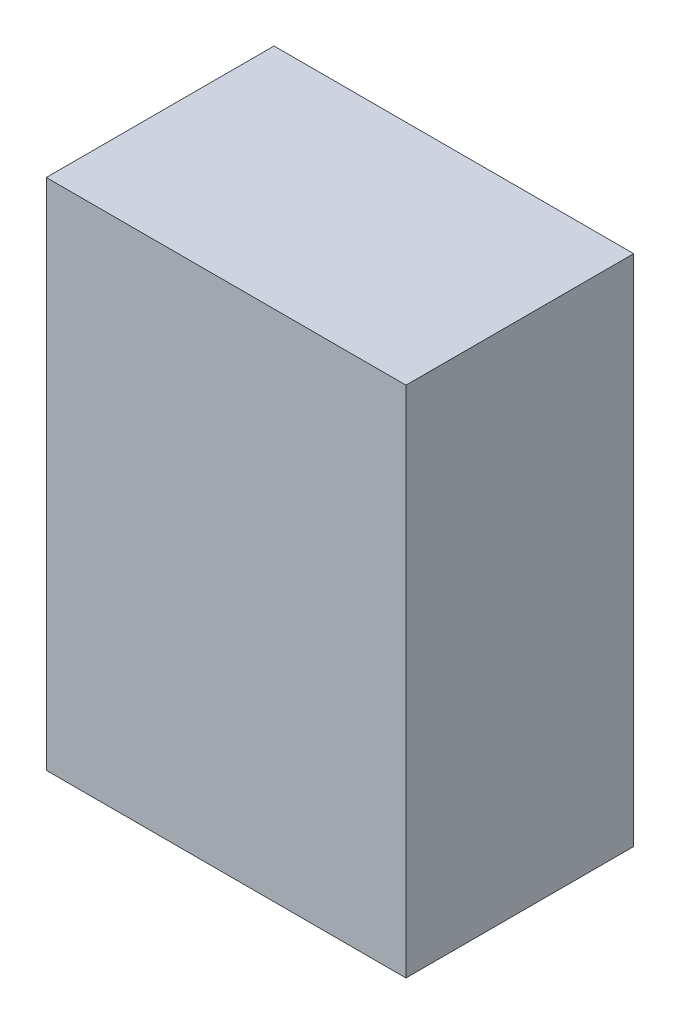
ISO-10303-21;
HEADER;
FILE_DESCRIPTION(('STEP AP214'),'2;1');
FILE_NAME('part.step','',(''),(''),'','','');
FILE_SCHEMA(('AUTOMOTIVE_DESIGN { 1 0 10303 214 1 1 1 1 }'));
ENDSEC;
DATA;
#1=APPLICATION_CONTEXT('core data for automotive mechanical design processes');
#2=APPLICATION_PROTOCOL_DEFINITION('international standard','automotive_design',2000,#1);
#3=PRODUCT_CONTEXT('',#1,'mechanical');
#4=PRODUCT('Part','Part','',(#3));
#5=PRODUCT_RELATED_PRODUCT_CATEGORY('part','',(#4));
#6=PRODUCT_DEFINITION_FORMATION('','',#4);
#7=PRODUCT_DEFINITION_CONTEXT('part definition',#1,'design');
#8=PRODUCT_DEFINITION('design','',#6,#7);
#9=PRODUCT_DEFINITION_SHAPE('','',#8);
#10=(LENGTH_UNIT() NAMED_UNIT(*) SI_UNIT(.MILLI.,.METRE.));
#11=(NAMED_UNIT(*) PLANE_ANGLE_UNIT() SI_UNIT($,.RADIAN.));
#12=(NAMED_UNIT(*) SI_UNIT($,.STERADIAN.) SOLID_ANGLE_UNIT());
#13=UNCERTAINTY_MEASURE_WITH_UNIT(LENGTH_MEASURE(1.E-05),#10,'distance_accuracy_value','');
#14=(GEOMETRIC_REPRESENTATION_CONTEXT(3) GLOBAL_UNCERTAINTY_ASSIGNED_CONTEXT((#13)) GLOBAL_UNIT_ASSIGNED_CONTEXT((#10,
#11,#12)) REPRESENTATION_CONTEXT('',''));
#15=CARTESIAN_POINT('',(0.,0.,0.));
#16=DIRECTION('',(0.,0.,1.));
#17=DIRECTION('',(1.,0.,0.));
#18=AXIS2_PLACEMENT_3D('',#15,#16,#17);
#19=CARTESIAN_POINT('',(-26.120717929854,12.078957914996,4.962500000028));
#20=DIRECTION('',(-1.,0.,0.));
#21=DIRECTION('',(0.,0.,1.));
#22=AXIS2_PLACEMENT_3D('',#19,#20,#21);
#23=PLANE('',#22);
#24=DIRECTION('',(0.,0.,-1.));
#25=VECTOR('',#24,1.);
#26=CARTESIAN_POINT('',(-26.120717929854,4.498107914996,4.962500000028));
#27=LINE('',#26,#25);
#28=CARTESIAN_POINT('',(-26.120717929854,4.498107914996,8.325000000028));
#29=VERTEX_POINT('',#28);
#30=CARTESIAN_POINT('',(-26.120717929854,4.498107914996,1.600000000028));
#31=VERTEX_POINT('',#30);
#32=EDGE_CURVE('E77',#29,#31,#27,.T.);
#33=ORIENTED_EDGE('',*,*,#32,.T.);
#34=DIRECTION('',(0.,-1.,0.));
#35=VECTOR('',#34,1.);
#36=CARTESIAN_POINT('',(-26.120717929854,12.078957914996,1.600000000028));
#37=LINE('',#36,#35);
#38=CARTESIAN_POINT('',(-26.120717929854,19.659807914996,1.600000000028));
#39=VERTEX_POINT('',#38);
#40=EDGE_CURVE('E87',#39,#31,#37,.T.);
#41=ORIENTED_EDGE('',*,*,#40,.F.);
#42=DIRECTION('',(0.,0.,-1.));
#43=VECTOR('',#42,1.);
#44=CARTESIAN_POINT('',(-26.120717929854,19.659807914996,4.962500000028));
#45=LINE('',#44,#43);
#46=CARTESIAN_POINT('',(-26.120717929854,19.659807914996,8.325000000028));
#47=VERTEX_POINT('',#46);
#48=EDGE_CURVE('E11',#47,#39,#45,.T.);
#49=ORIENTED_EDGE('',*,*,#48,.F.);
#50=DIRECTION('',(0.,1.,0.));
#51=VECTOR('',#50,1.);
#52=CARTESIAN_POINT('',(-26.120717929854,12.078957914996,8.325000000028));
#53=LINE('',#52,#51);
#54=EDGE_CURVE('E96',#29,#47,#53,.T.);
#55=ORIENTED_EDGE('',*,*,#54,.F.);
#56=EDGE_LOOP('',(#33,#41,#49,#55));
#57=FACE_BOUND('',#56,.T.);
#58=ADVANCED_FACE('F17',(#57),#23,.F.);
#59=CARTESIAN_POINT('',(-31.431717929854,19.659807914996,4.962500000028));
#60=DIRECTION('',(0.,-1.,0.));
#61=DIRECTION('',(0.,0.,-1.));
#62=AXIS2_PLACEMENT_3D('',#59,#60,#61);
#63=PLANE('',#62);
#64=ORIENTED_EDGE('',*,*,#48,.T.);
#65=DIRECTION('',(1.,0.,0.));
#66=VECTOR('',#65,1.);
#67=CARTESIAN_POINT('',(-31.431717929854,19.659807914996,1.600000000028));
#68=LINE('',#67,#66);
#69=CARTESIAN_POINT('',(-36.742717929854,19.659807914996,1.600000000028));
#70=VERTEX_POINT('',#69);
#71=EDGE_CURVE('E78',#70,#39,#68,.T.);
#72=ORIENTED_EDGE('',*,*,#71,.F.);
#73=DIRECTION('',(0.,0.,-1.));
#74=VECTOR('',#73,1.);
#75=CARTESIAN_POINT('',(-36.742717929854,19.659807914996,4.962500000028));
#76=LINE('',#75,#74);
#77=CARTESIAN_POINT('',(-36.742717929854,19.659807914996,8.325000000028));
#78=VERTEX_POINT('',#77);
#79=EDGE_CURVE('E28',#78,#70,#76,.T.);
#80=ORIENTED_EDGE('',*,*,#79,.F.);
#81=DIRECTION('',(-1.,0.,0.));
#82=VECTOR('',#81,1.);
#83=CARTESIAN_POINT('',(-31.431717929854,19.659807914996,8.325000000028));
#84=LINE('',#83,#82);
#85=EDGE_CURVE('E90',#47,#78,#84,.T.);
#86=ORIENTED_EDGE('',*,*,#85,.F.);
#87=EDGE_LOOP('',(#64,#72,#80,#86));
#88=FACE_BOUND('',#87,.T.);
#89=ADVANCED_FACE('F134',(#88),#63,.F.);
#90=CARTESIAN_POINT('',(-36.742717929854,12.078957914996,4.962500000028));
#91=DIRECTION('',(1.,0.,0.));
#92=DIRECTION('',(0.,1.,0.));
#93=AXIS2_PLACEMENT_3D('',#90,#91,#92);
#94=PLANE('',#93);
#95=ORIENTED_EDGE('',*,*,#79,.T.);
#96=DIRECTION('',(0.,1.,0.));
#97=VECTOR('',#96,1.);
#98=CARTESIAN_POINT('',(-36.742717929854,12.078957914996,1.600000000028));
#99=LINE('',#98,#97);
#100=CARTESIAN_POINT('',(-36.742717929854,4.498107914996,1.600000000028));
#101=VERTEX_POINT('',#100);
#102=EDGE_CURVE('E72',#101,#70,#99,.T.);
#103=ORIENTED_EDGE('',*,*,#102,.F.);
#104=DIRECTION('',(0.,0.,-1.));
#105=VECTOR('',#104,1.);
#106=CARTESIAN_POINT('',(-36.742717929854,4.498107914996,4.962500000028));
#107=LINE('',#106,#105);
#108=CARTESIAN_POINT('',(-36.742717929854,4.498107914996,8.325000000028));
#109=VERTEX_POINT('',#108);
#110=EDGE_CURVE('E21',#109,#101,#107,.T.);
#111=ORIENTED_EDGE('',*,*,#110,.F.);
#112=DIRECTION('',(0.,-1.,0.));
#113=VECTOR('',#112,1.);
#114=CARTESIAN_POINT('',(-36.742717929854,12.078957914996,8.325000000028));
#115=LINE('',#114,#113);
#116=EDGE_CURVE('E69',#78,#109,#115,.T.);
#117=ORIENTED_EDGE('',*,*,#116,.F.);
#118=EDGE_LOOP('',(#95,#103,#111,#117));
#119=FACE_BOUND('',#118,.T.);
#120=ADVANCED_FACE('F19',(#119),#94,.F.);
#121=CARTESIAN_POINT('',(-31.431717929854,4.498107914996,4.962500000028));
#122=DIRECTION('',(0.,1.,0.));
#123=DIRECTION('',(1.,0.,0.));
#124=AXIS2_PLACEMENT_3D('',#121,#122,#123);
#125=PLANE('',#124);
#126=ORIENTED_EDGE('',*,*,#110,.T.);
#127=DIRECTION('',(-1.,0.,0.));
#128=VECTOR('',#127,1.);
#129=CARTESIAN_POINT('',(-31.431717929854,4.498107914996,1.600000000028));
#130=LINE('',#129,#128);
#131=EDGE_CURVE('E99',#31,#101,#130,.T.);
#132=ORIENTED_EDGE('',*,*,#131,.F.);
#133=ORIENTED_EDGE('',*,*,#32,.F.);
#134=DIRECTION('',(1.,0.,0.));
#135=VECTOR('',#134,1.);
#136=CARTESIAN_POINT('',(-31.431717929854,4.498107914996,8.325000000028));
#137=LINE('',#136,#135);
#138=EDGE_CURVE('E81',#109,#29,#137,.T.);
#139=ORIENTED_EDGE('',*,*,#138,.F.);
#140=EDGE_LOOP('',(#126,#132,#133,#139));
#141=FACE_BOUND('',#140,.T.);
#142=ADVANCED_FACE('F82',(#141),#125,.F.);
#143=CARTESIAN_POINT('',(-31.431717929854,12.078957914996,1.600000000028));
#144=DIRECTION('',(0.,0.,1.));
#145=DIRECTION('',(1.,0.,0.));
#146=AXIS2_PLACEMENT_3D('',#143,#144,#145);
#147=PLANE('',#146);
#148=ORIENTED_EDGE('',*,*,#40,.T.);
#149=ORIENTED_EDGE('',*,*,#131,.T.);
#150=ORIENTED_EDGE('',*,*,#102,.T.);
#151=ORIENTED_EDGE('',*,*,#71,.T.);
#152=EDGE_LOOP('',(#148,#149,#150,#151));
#153=FACE_BOUND('',#152,.T.);
#154=ADVANCED_FACE('F122',(#153),#147,.F.);
#155=CARTESIAN_POINT('',(-31.431717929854,12.078957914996,8.325000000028));
#156=DIRECTION('',(0.,0.,1.));
#157=DIRECTION('',(1.,0.,0.));
#158=AXIS2_PLACEMENT_3D('',#155,#156,#157);
#159=PLANE('',#158);
#160=ORIENTED_EDGE('',*,*,#54,.T.);
#161=ORIENTED_EDGE('',*,*,#85,.T.);
#162=ORIENTED_EDGE('',*,*,#116,.T.);
#163=ORIENTED_EDGE('',*,*,#138,.T.);
#164=EDGE_LOOP('',(#160,#161,#162,#163));
#165=FACE_BOUND('',#164,.T.);
#166=ADVANCED_FACE('F89',(#165),#159,.T.);
#167=CLOSED_SHELL('',(#58,#89,#120,#142,#154,#166));
#168=MANIFOLD_SOLID_BREP('B1',#167);
#169=ADVANCED_BREP_SHAPE_REPRESENTATION('',(#18,#168),#14);
#170=SHAPE_DEFINITION_REPRESENTATION(#9,#169);
ENDSEC;
END-ISO-10303-21;
